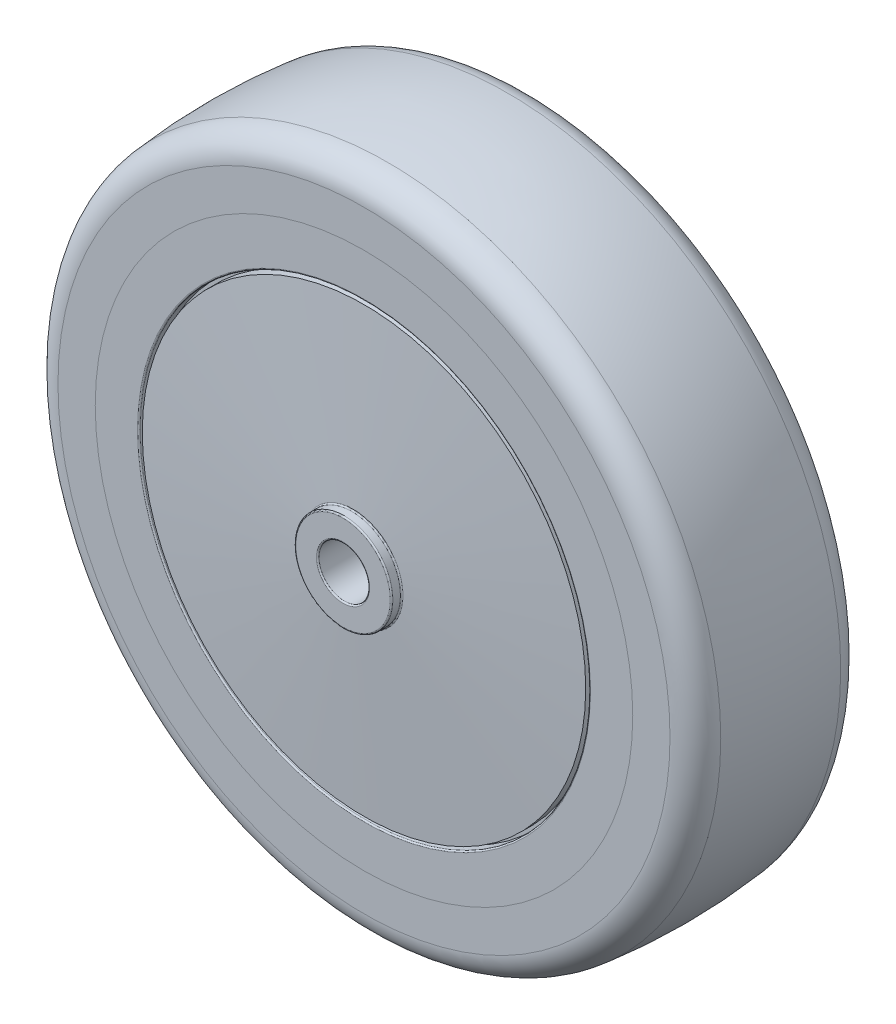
ISO-10303-21;
HEADER;
FILE_DESCRIPTION(('STEP AP214'),'2;1');
FILE_NAME('part.step','',(''),(''),'','','');
FILE_SCHEMA(('AUTOMOTIVE_DESIGN { 1 0 10303 214 1 1 1 1 }'));
ENDSEC;
DATA;
#1=APPLICATION_CONTEXT('core data for automotive mechanical design processes');
#2=APPLICATION_PROTOCOL_DEFINITION('international standard','automotive_design',2000,#1);
#3=PRODUCT_CONTEXT('',#1,'mechanical');
#4=PRODUCT('Part','Part','',(#3));
#5=PRODUCT_RELATED_PRODUCT_CATEGORY('part','',(#4));
#6=PRODUCT_DEFINITION_FORMATION('','',#4);
#7=PRODUCT_DEFINITION_CONTEXT('part definition',#1,'design');
#8=PRODUCT_DEFINITION('design','',#6,#7);
#9=PRODUCT_DEFINITION_SHAPE('','',#8);
#10=(LENGTH_UNIT() NAMED_UNIT(*) SI_UNIT(.MILLI.,.METRE.));
#11=(NAMED_UNIT(*) PLANE_ANGLE_UNIT() SI_UNIT($,.RADIAN.));
#12=(NAMED_UNIT(*) SI_UNIT($,.STERADIAN.) SOLID_ANGLE_UNIT());
#13=UNCERTAINTY_MEASURE_WITH_UNIT(LENGTH_MEASURE(1.E-05),#10,'distance_accuracy_value','');
#14=(GEOMETRIC_REPRESENTATION_CONTEXT(3) GLOBAL_UNCERTAINTY_ASSIGNED_CONTEXT((#13)) GLOBAL_UNIT_ASSIGNED_CONTEXT((#10,
#11,#12)) REPRESENTATION_CONTEXT('',''));
#15=CARTESIAN_POINT('',(0.,0.,0.));
#16=DIRECTION('',(0.,0.,1.));
#17=DIRECTION('',(1.,0.,0.));
#18=AXIS2_PLACEMENT_3D('',#15,#16,#17);
#19=CARTESIAN_POINT('',(0.,0.,-159.559097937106));
#20=DIRECTION('',(0.,0.,1.));
#21=DIRECTION('',(1.,0.,0.));
#22=AXIS2_PLACEMENT_3D('',#19,#20,#21);
#23=CYLINDRICAL_SURFACE('',#22,50.8);
#24=CARTESIAN_POINT('',(0.,0.,-15.875));
#25=DIRECTION('',(0.,0.,1.));
#26=DIRECTION('',(1.,0.,0.));
#27=AXIS2_PLACEMENT_3D('',#24,#25,#26);
#28=CIRCLE('',#27,50.8);
#29=CARTESIAN_POINT('',(50.8,0.,-15.875));
#30=VERTEX_POINT('',#29);
#31=EDGE_CURVE('E63',#30,#30,#28,.F.);
#32=ORIENTED_EDGE('',*,*,#31,.F.);
#33=EDGE_LOOP('',(#32));
#34=FACE_BOUND('',#33,.T.);
#35=CARTESIAN_POINT('',(0.,0.,15.875));
#36=DIRECTION('',(0.,0.,1.));
#37=DIRECTION('',(1.,0.,0.));
#38=AXIS2_PLACEMENT_3D('',#35,#36,#37);
#39=CIRCLE('',#38,50.8);
#40=CARTESIAN_POINT('',(50.8,0.,15.875));
#41=VERTEX_POINT('',#40);
#42=EDGE_CURVE('E64',#41,#41,#39,.T.);
#43=ORIENTED_EDGE('',*,*,#42,.F.);
#44=EDGE_LOOP('',(#43));
#45=FACE_BOUND('',#44,.T.);
#46=ADVANCED_FACE('F43',(#34,#45),#23,.T.);
#47=CARTESIAN_POINT('',(0.,0.,15.875));
#48=DIRECTION('',(0.,0.,1.));
#49=DIRECTION('',(1.,0.,0.));
#50=AXIS2_PLACEMENT_3D('',#47,#48,#49);
#51=PLANE('',#50);
#52=CARTESIAN_POINT('',(0.,0.,15.875));
#53=DIRECTION('',(0.,0.,1.));
#54=DIRECTION('',(1.,0.,0.));
#55=AXIS2_PLACEMENT_3D('',#52,#53,#54);
#56=CIRCLE('',#55,42.799);
#57=CARTESIAN_POINT('',(42.799,0.,15.875));
#58=VERTEX_POINT('',#57);
#59=EDGE_CURVE('E11',#58,#58,#56,.F.);
#60=ORIENTED_EDGE('',*,*,#59,.T.);
#61=EDGE_LOOP('',(#60));
#62=FACE_BOUND('',#61,.T.);
#63=ORIENTED_EDGE('',*,*,#42,.T.);
#64=EDGE_LOOP('',(#63));
#65=FACE_BOUND('',#64,.T.);
#66=ADVANCED_FACE('F74',(#62,#65),#51,.T.);
#67=CARTESIAN_POINT('',(0.,0.,-159.559097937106));
#68=DIRECTION('',(0.,0.,1.));
#69=DIRECTION('',(1.,0.,0.));
#70=AXIS2_PLACEMENT_3D('',#67,#68,#69);
#71=CYLINDRICAL_SURFACE('',#70,42.545);
#72=CARTESIAN_POINT('',(0.,0.,-15.621));
#73=DIRECTION('',(0.,0.,1.));
#74=DIRECTION('',(1.,0.,0.));
#75=AXIS2_PLACEMENT_3D('',#72,#73,#74);
#76=CIRCLE('',#75,42.545);
#77=CARTESIAN_POINT('',(42.545,0.,-15.621));
#78=VERTEX_POINT('',#77);
#79=EDGE_CURVE('E54',#78,#78,#76,.F.);
#80=ORIENTED_EDGE('',*,*,#79,.T.);
#81=EDGE_LOOP('',(#80));
#82=FACE_BOUND('',#81,.T.);
#83=CARTESIAN_POINT('',(0.,0.,15.621));
#84=DIRECTION('',(0.,0.,1.));
#85=DIRECTION('',(1.,0.,0.));
#86=AXIS2_PLACEMENT_3D('',#83,#84,#85);
#87=CIRCLE('',#86,42.545);
#88=CARTESIAN_POINT('',(42.545,0.,15.621));
#89=VERTEX_POINT('',#88);
#90=EDGE_CURVE('E58',#89,#89,#87,.T.);
#91=ORIENTED_EDGE('',*,*,#90,.T.);
#92=EDGE_LOOP('',(#91));
#93=FACE_BOUND('',#92,.T.);
#94=ADVANCED_FACE('F79',(#82,#93),#71,.F.);
#95=CARTESIAN_POINT('',(0.,0.,-15.875));
#96=DIRECTION('',(0.,0.,1.));
#97=DIRECTION('',(1.,0.,0.));
#98=AXIS2_PLACEMENT_3D('',#95,#96,#97);
#99=PLANE('',#98);
#100=CARTESIAN_POINT('',(0.,0.,-15.875));
#101=DIRECTION('',(0.,0.,1.));
#102=DIRECTION('',(1.,0.,0.));
#103=AXIS2_PLACEMENT_3D('',#100,#101,#102);
#104=CIRCLE('',#103,42.799);
#105=CARTESIAN_POINT('',(42.799,0.,-15.875));
#106=VERTEX_POINT('',#105);
#107=EDGE_CURVE('E50',#106,#106,#104,.T.);
#108=ORIENTED_EDGE('',*,*,#107,.T.);
#109=EDGE_LOOP('',(#108));
#110=FACE_BOUND('',#109,.T.);
#111=ORIENTED_EDGE('',*,*,#31,.T.);
#112=EDGE_LOOP('',(#111));
#113=FACE_BOUND('',#112,.T.);
#114=ADVANCED_FACE('F70',(#110,#113),#99,.F.);
#115=CARTESIAN_POINT('',(0.,0.,-15.621));
#116=DIRECTION('',(0.,0.,1.));
#117=DIRECTION('',(1.,0.,0.));
#118=AXIS2_PLACEMENT_3D('',#115,#116,#117);
#119=TOROIDAL_SURFACE('',#118,42.799,0.254);
#120=ORIENTED_EDGE('',*,*,#107,.F.);
#121=EDGE_LOOP('',(#120));
#122=FACE_BOUND('',#121,.T.);
#123=ORIENTED_EDGE('',*,*,#79,.F.);
#124=EDGE_LOOP('',(#123));
#125=FACE_BOUND('',#124,.T.);
#126=ADVANCED_FACE('F87',(#122,#125),#119,.T.);
#127=CARTESIAN_POINT('',(0.,0.,15.621));
#128=DIRECTION('',(0.,0.,1.));
#129=DIRECTION('',(1.,0.,0.));
#130=AXIS2_PLACEMENT_3D('',#127,#128,#129);
#131=TOROIDAL_SURFACE('',#130,42.799,0.254);
#132=ORIENTED_EDGE('',*,*,#59,.F.);
#133=EDGE_LOOP('',(#132));
#134=FACE_BOUND('',#133,.T.);
#135=ORIENTED_EDGE('',*,*,#90,.F.);
#136=EDGE_LOOP('',(#135));
#137=FACE_BOUND('',#136,.T.);
#138=ADVANCED_FACE('F45',(#134,#137),#131,.T.);
#139=CLOSED_SHELL('',(#46,#66,#94,#114,#126,#138));
#140=MANIFOLD_SOLID_BREP('B2',#139);
#141=CARTESIAN_POINT('',(0.,0.,0.));
#142=DIRECTION('',(0.,0.,1.));
#143=DIRECTION('',(1.,0.,0.));
#144=AXIS2_PLACEMENT_3D('',#141,#142,#143);
#145=DEGENERATE_TOROIDAL_SURFACE('',#144,42.8690785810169,106.369078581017,.F.);
#146=CARTESIAN_POINT('',(0.,0.,-11.3364068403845));
#147=DIRECTION('',(0.,0.,1.));
#148=DIRECTION('',(1.,0.,0.));
#149=AXIS2_PLACEMENT_3D('',#146,#147,#148);
#150=CIRCLE('',#149,62.8941794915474);
#151=CARTESIAN_POINT('',(62.8941794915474,0.,-11.3364068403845));
#152=VERTEX_POINT('',#151);
#153=EDGE_CURVE('E185',#152,#152,#150,.T.);
#154=ORIENTED_EDGE('',*,*,#153,.T.);
#155=EDGE_LOOP('',(#154));
#156=FACE_BOUND('',#155,.T.);
#157=CARTESIAN_POINT('',(0.,0.,11.3364068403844));
#158=DIRECTION('',(0.,0.,-1.));
#159=DIRECTION('',(-1.,0.,0.));
#160=AXIS2_PLACEMENT_3D('',#157,#158,#159);
#161=CIRCLE('',#160,62.8941794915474);
#162=CARTESIAN_POINT('',(-62.8941794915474,0.,11.3364068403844));
#163=VERTEX_POINT('',#162);
#164=EDGE_CURVE('E188',#163,#163,#161,.T.);
#165=ORIENTED_EDGE('',*,*,#164,.T.);
#166=EDGE_LOOP('',(#165));
#167=FACE_BOUND('',#166,.T.);
#168=ADVANCED_FACE('F135',(#156,#167),#145,.F.);
#169=CARTESIAN_POINT('',(0.,0.,-15.875));
#170=DIRECTION('',(0.,0.,1.));
#171=DIRECTION('',(1.,0.,0.));
#172=AXIS2_PLACEMENT_3D('',#169,#170,#171);
#173=PLANE('',#172);
#174=CARTESIAN_POINT('',(0.,0.,-15.875));
#175=DIRECTION('',(0.,0.,1.));
#176=DIRECTION('',(1.,0.,0.));
#177=AXIS2_PLACEMENT_3D('',#174,#175,#176);
#178=CIRCLE('',#177,57.8431124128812);
#179=CARTESIAN_POINT('',(57.8431124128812,0.,-15.875));
#180=VERTEX_POINT('',#179);
#181=EDGE_CURVE('E182',#180,#180,#178,.F.);
#182=ORIENTED_EDGE('',*,*,#181,.T.);
#183=EDGE_LOOP('',(#182));
#184=FACE_BOUND('',#183,.T.);
#185=CARTESIAN_POINT('',(0.,0.,-15.875));
#186=DIRECTION('',(0.,0.,1.));
#187=DIRECTION('',(1.,0.,0.));
#188=AXIS2_PLACEMENT_3D('',#185,#186,#187);
#189=CIRCLE('',#188,50.8);
#190=CARTESIAN_POINT('',(50.8,0.,-15.875));
#191=VERTEX_POINT('',#190);
#192=EDGE_CURVE('E197',#191,#191,#189,.T.);
#193=ORIENTED_EDGE('',*,*,#192,.T.);
#194=EDGE_LOOP('',(#193));
#195=FACE_BOUND('',#194,.T.);
#196=ADVANCED_FACE('F236',(#184,#195),#173,.F.);
#197=CARTESIAN_POINT('',(0.,0.,86.9689476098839));
#198=DIRECTION('',(0.,0.,1.));
#199=DIRECTION('',(1.,0.,0.));
#200=AXIS2_PLACEMENT_3D('',#197,#198,#199);
#201=CYLINDRICAL_SURFACE('',#200,50.8);
#202=ORIENTED_EDGE('',*,*,#192,.F.);
#203=EDGE_LOOP('',(#202));
#204=FACE_BOUND('',#203,.T.);
#205=CARTESIAN_POINT('',(0.,0.,-13.97));
#206=DIRECTION('',(0.,0.,1.));
#207=DIRECTION('',(1.,0.,0.));
#208=AXIS2_PLACEMENT_3D('',#205,#206,#207);
#209=CIRCLE('',#208,50.8);
#210=CARTESIAN_POINT('',(50.8,0.,-13.97));
#211=VERTEX_POINT('',#210);
#212=EDGE_CURVE('E200',#211,#211,#209,.T.);
#213=ORIENTED_EDGE('',*,*,#212,.T.);
#214=EDGE_LOOP('',(#213));
#215=FACE_BOUND('',#214,.T.);
#216=ADVANCED_FACE('F242',(#204,#215),#201,.F.);
#217=CARTESIAN_POINT('',(0.,0.,-13.97));
#218=DIRECTION('',(0.,0.,1.));
#219=DIRECTION('',(1.,0.,0.));
#220=AXIS2_PLACEMENT_3D('',#217,#218,#219);
#221=PLANE('',#220);
#222=CARTESIAN_POINT('',(0.,0.,-13.97));
#223=DIRECTION('',(0.,0.,1.));
#224=DIRECTION('',(1.,0.,0.));
#225=AXIS2_PLACEMENT_3D('',#222,#223,#224);
#226=CIRCLE('',#225,41.91);
#227=CARTESIAN_POINT('',(41.91,0.,-13.97));
#228=VERTEX_POINT('',#227);
#229=EDGE_CURVE('E191',#228,#228,#226,.F.);
#230=ORIENTED_EDGE('',*,*,#229,.F.);
#231=EDGE_LOOP('',(#230));
#232=FACE_BOUND('',#231,.T.);
#233=ORIENTED_EDGE('',*,*,#212,.F.);
#234=EDGE_LOOP('',(#233));
#235=FACE_BOUND('',#234,.T.);
#236=ADVANCED_FACE('F312',(#232,#235),#221,.F.);
#237=CARTESIAN_POINT('',(0.,0.,13.97));
#238=DIRECTION('',(0.,0.,1.));
#239=DIRECTION('',(1.,0.,0.));
#240=AXIS2_PLACEMENT_3D('',#237,#238,#239);
#241=PLANE('',#240);
#242=CARTESIAN_POINT('',(0.,0.,13.97));
#243=DIRECTION('',(0.,0.,1.));
#244=DIRECTION('',(1.,0.,0.));
#245=AXIS2_PLACEMENT_3D('',#242,#243,#244);
#246=CIRCLE('',#245,41.91);
#247=CARTESIAN_POINT('',(41.91,0.,13.97));
#248=VERTEX_POINT('',#247);
#249=EDGE_CURVE('E192',#248,#248,#246,.F.);
#250=ORIENTED_EDGE('',*,*,#249,.T.);
#251=EDGE_LOOP('',(#250));
#252=FACE_BOUND('',#251,.T.);
#253=CARTESIAN_POINT('',(0.,0.,13.97));
#254=DIRECTION('',(0.,0.,1.));
#255=DIRECTION('',(1.,0.,0.));
#256=AXIS2_PLACEMENT_3D('',#253,#254,#255);
#257=CIRCLE('',#256,50.8);
#258=CARTESIAN_POINT('',(50.8,0.,13.97));
#259=VERTEX_POINT('',#258);
#260=EDGE_CURVE('E203',#259,#259,#257,.T.);
#261=ORIENTED_EDGE('',*,*,#260,.T.);
#262=EDGE_LOOP('',(#261));
#263=FACE_BOUND('',#262,.T.);
#264=ADVANCED_FACE('F315',(#252,#263),#241,.T.);
#265=CARTESIAN_POINT('',(0.,0.,86.9689476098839));
#266=DIRECTION('',(0.,0.,1.));
#267=DIRECTION('',(1.,0.,0.));
#268=AXIS2_PLACEMENT_3D('',#265,#266,#267);
#269=CYLINDRICAL_SURFACE('',#268,50.8);
#270=CARTESIAN_POINT('',(0.,0.,15.875));
#271=DIRECTION('',(0.,0.,1.));
#272=DIRECTION('',(1.,0.,0.));
#273=AXIS2_PLACEMENT_3D('',#270,#271,#272);
#274=CIRCLE('',#273,50.8);
#275=CARTESIAN_POINT('',(50.8,0.,15.875));
#276=VERTEX_POINT('',#275);
#277=EDGE_CURVE('E195',#276,#276,#274,.T.);
#278=ORIENTED_EDGE('',*,*,#277,.T.);
#279=EDGE_LOOP('',(#278));
#280=FACE_BOUND('',#279,.T.);
#281=ORIENTED_EDGE('',*,*,#260,.F.);
#282=EDGE_LOOP('',(#281));
#283=FACE_BOUND('',#282,.T.);
#284=ADVANCED_FACE('F327',(#280,#283),#269,.F.);
#285=CARTESIAN_POINT('',(0.,0.,15.875));
#286=DIRECTION('',(0.,0.,1.));
#287=DIRECTION('',(1.,0.,0.));
#288=AXIS2_PLACEMENT_3D('',#285,#286,#287);
#289=PLANE('',#288);
#290=CARTESIAN_POINT('',(0.,0.,15.875));
#291=DIRECTION('',(0.,0.,1.));
#292=DIRECTION('',(1.,0.,0.));
#293=AXIS2_PLACEMENT_3D('',#290,#291,#292);
#294=CIRCLE('',#293,57.8431124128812);
#295=CARTESIAN_POINT('',(57.8431124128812,0.,15.875));
#296=VERTEX_POINT('',#295);
#297=EDGE_CURVE('E179',#296,#296,#294,.T.);
#298=ORIENTED_EDGE('',*,*,#297,.T.);
#299=EDGE_LOOP('',(#298));
#300=FACE_BOUND('',#299,.T.);
#301=ORIENTED_EDGE('',*,*,#277,.F.);
#302=EDGE_LOOP('',(#301));
#303=FACE_BOUND('',#302,.T.);
#304=ADVANCED_FACE('F298',(#300,#303),#289,.T.);
#305=CARTESIAN_POINT('',(0.,9.1821,19.84375));
#306=DIRECTION('',(0.,0.,-1.));
#307=DIRECTION('',(-1.,0.,0.));
#308=AXIS2_PLACEMENT_3D('',#305,#306,#307);
#309=PLANE('',#308);
#310=CARTESIAN_POINT('',(0.,0.,19.84375));
#311=DIRECTION('',(0.,0.,-1.));
#312=DIRECTION('',(-1.,0.,0.));
#313=AXIS2_PLACEMENT_3D('',#310,#311,#312);
#314=CIRCLE('',#313,5.0165);
#315=CARTESIAN_POINT('',(-5.0165,0.,19.84375));
#316=VERTEX_POINT('',#315);
#317=EDGE_CURVE('E42',#316,#316,#314,.T.);
#318=ORIENTED_EDGE('',*,*,#317,.T.);
#319=EDGE_LOOP('',(#318));
#320=FACE_BOUND('',#319,.T.);
#321=CARTESIAN_POINT('',(0.,0.,19.84375));
#322=DIRECTION('',(0.,0.,-1.));
#323=DIRECTION('',(-1.,0.,0.));
#324=AXIS2_PLACEMENT_3D('',#321,#322,#323);
#325=CIRCLE('',#324,8.9281);
#326=CARTESIAN_POINT('',(-8.9281,0.,19.84375));
#327=VERTEX_POINT('',#326);
#328=EDGE_CURVE('E142',#327,#327,#325,.F.);
#329=ORIENTED_EDGE('',*,*,#328,.T.);
#330=EDGE_LOOP('',(#329));
#331=FACE_BOUND('',#330,.T.);
#332=ADVANCED_FACE('F295',(#320,#331),#309,.F.);
#333=CARTESIAN_POINT('',(0.,0.,0.));
#334=DIRECTION('',(0.,0.,1.));
#335=DIRECTION('',(1.,0.,0.));
#336=AXIS2_PLACEMENT_3D('',#333,#334,#335);
#337=CYLINDRICAL_SURFACE('',#336,9.1821);
#338=CARTESIAN_POINT('',(0.,0.,18.1772378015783));
#339=DIRECTION('',(0.,0.,1.));
#340=DIRECTION('',(1.,0.,0.));
#341=AXIS2_PLACEMENT_3D('',#338,#339,#340);
#342=CIRCLE('',#341,9.1821);
#343=CARTESIAN_POINT('',(9.1821,0.,18.1772378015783));
#344=VERTEX_POINT('',#343);
#345=EDGE_CURVE('E173',#344,#344,#342,.T.);
#346=ORIENTED_EDGE('',*,*,#345,.T.);
#347=EDGE_LOOP('',(#346));
#348=FACE_BOUND('',#347,.T.);
#349=CARTESIAN_POINT('',(0.,0.,19.58975));
#350=DIRECTION('',(0.,0.,-1.));
#351=DIRECTION('',(-1.,0.,0.));
#352=AXIS2_PLACEMENT_3D('',#349,#350,#351);
#353=CIRCLE('',#352,9.1821);
#354=CARTESIAN_POINT('',(-9.1821,0.,19.58975));
#355=VERTEX_POINT('',#354);
#356=EDGE_CURVE('E176',#355,#355,#353,.T.);
#357=ORIENTED_EDGE('',*,*,#356,.T.);
#358=EDGE_LOOP('',(#357));
#359=FACE_BOUND('',#358,.T.);
#360=ADVANCED_FACE('F229',(#348,#359),#337,.T.);
#361=CARTESIAN_POINT('',(0.,0.,15.875));
#362=DIRECTION('',(0.,0.,-1.));
#363=DIRECTION('',(-1.,0.,0.));
#364=AXIS2_PLACEMENT_3D('',#361,#362,#363);
#365=CONICAL_SURFACE('',#364,41.91,1.50782188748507);
#366=CARTESIAN_POINT('',(0.,0.,17.9237412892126));
#367=DIRECTION('',(0.,0.,-1.));
#368=DIRECTION('',(-1.,0.,0.));
#369=AXIS2_PLACEMENT_3D('',#366,#367,#368);
#370=CIRCLE('',#369,9.42011506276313);
#371=CARTESIAN_POINT('',(-9.42011506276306,0.,17.9237412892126));
#372=VERTEX_POINT('',#371);
#373=EDGE_CURVE('E170',#372,#372,#370,.T.);
#374=CARTESIAN_POINT('',(0.,0.,15.875));
#375=DIRECTION('',(0.,0.,1.));
#376=DIRECTION('',(1.,0.,0.));
#377=AXIS2_PLACEMENT_3D('',#374,#375,#376);
#378=CIRCLE('',#377,41.91);
#379=CARTESIAN_POINT('',(-41.91,0.,15.875));
#380=VERTEX_POINT('',#379);
#381=EDGE_CURVE('E212',#380,#380,#378,.T.);
#382=CARTESIAN_POINT('',(-9.42011506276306,0.,17.9237412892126));
#383=CARTESIAN_POINT('',(-9.75855136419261,0.,17.9024002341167));
#384=CARTESIAN_POINT('',(-10.0969876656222,0.,17.8810591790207));
#385=CARTESIAN_POINT('',(-10.7738602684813,0.,17.8383770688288));
#386=CARTESIAN_POINT('',(-11.1122965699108,0.,17.8170360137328));
#387=CARTESIAN_POINT('',(-11.7891691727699,0.,17.7743539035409));
#388=CARTESIAN_POINT('',(-12.1276054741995,0.,17.7530128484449));
#389=CARTESIAN_POINT('',(-12.8044780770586,0.,17.710330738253));
#390=CARTESIAN_POINT('',(-13.1429143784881,0.,17.688989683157));
#391=CARTESIAN_POINT('',(-13.8197869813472,0.,17.6463075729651));
#392=CARTESIAN_POINT('',(-14.1582232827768,0.,17.6249665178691));
#393=CARTESIAN_POINT('',(-14.8350958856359,0.,17.5822844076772));
#394=CARTESIAN_POINT('',(-15.1735321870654,0.,17.5609433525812));
#395=CARTESIAN_POINT('',(-15.8504047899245,0.,17.5182612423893));
#396=CARTESIAN_POINT('',(-16.1888410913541,0.,17.4969201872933));
#397=CARTESIAN_POINT('',(-16.8657136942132,0.,17.4542380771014));
#398=CARTESIAN_POINT('',(-17.2041499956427,0.,17.4328970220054));
#399=CARTESIAN_POINT('',(-17.8810225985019,0.,17.3902149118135));
#400=CARTESIAN_POINT('',(-18.2194588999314,0.,17.3688738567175));
#401=CARTESIAN_POINT('',(-18.8963315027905,0.,17.3261917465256));
#402=CARTESIAN_POINT('',(-19.2347678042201,0.,17.3048506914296));
#403=CARTESIAN_POINT('',(-19.9116404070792,0.,17.2621685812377));
#404=CARTESIAN_POINT('',(-20.2500767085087,0.,17.2408275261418));
#405=CARTESIAN_POINT('',(-20.9269493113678,0.,17.1981454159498));
#406=CARTESIAN_POINT('',(-21.2653856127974,0.,17.1768043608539));
#407=CARTESIAN_POINT('',(-21.9422582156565,0.,17.1341222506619));
#408=CARTESIAN_POINT('',(-22.280694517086,0.,17.112781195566));
#409=CARTESIAN_POINT('',(-22.9575671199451,0.,17.070099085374));
#410=CARTESIAN_POINT('',(-23.2960034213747,0.,17.0487580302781));
#411=CARTESIAN_POINT('',(-23.9728760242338,0.,17.0060759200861));
#412=CARTESIAN_POINT('',(-24.3113123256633,0.,16.9847348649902));
#413=CARTESIAN_POINT('',(-24.9881849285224,0.,16.9420527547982));
#414=CARTESIAN_POINT('',(-25.326621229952,0.,16.9207116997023));
#415=CARTESIAN_POINT('',(-26.0034938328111,0.,16.8780295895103));
#416=CARTESIAN_POINT('',(-26.3419301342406,0.,16.8566885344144));
#417=CARTESIAN_POINT('',(-27.0188027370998,0.,16.8140064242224));
#418=CARTESIAN_POINT('',(-27.3572390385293,0.,16.7926653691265));
#419=CARTESIAN_POINT('',(-28.0341116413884,0.,16.7499832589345));
#420=CARTESIAN_POINT('',(-28.372547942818,0.,16.7286422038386));
#421=CARTESIAN_POINT('',(-29.0494205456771,0.,16.6859600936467));
#422=CARTESIAN_POINT('',(-29.3878568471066,0.,16.6646190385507));
#423=CARTESIAN_POINT('',(-30.0647294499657,0.,16.6219369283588));
#424=CARTESIAN_POINT('',(-30.4031657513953,0.,16.6005958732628));
#425=CARTESIAN_POINT('',(-31.0800383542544,0.,16.5579137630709));
#426=CARTESIAN_POINT('',(-31.4184746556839,0.,16.5365727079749));
#427=CARTESIAN_POINT('',(-32.095347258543,0.,16.493890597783));
#428=CARTESIAN_POINT('',(-32.4337835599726,0.,16.472549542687));
#429=CARTESIAN_POINT('',(-33.1106561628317,0.,16.4298674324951));
#430=CARTESIAN_POINT('',(-33.4490924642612,0.,16.4085263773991));
#431=CARTESIAN_POINT('',(-34.1259650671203,0.,16.3658442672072));
#432=CARTESIAN_POINT('',(-34.4644013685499,0.,16.3445032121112));
#433=CARTESIAN_POINT('',(-35.141273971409,0.,16.3018211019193));
#434=CARTESIAN_POINT('',(-35.4797102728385,0.,16.2804800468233));
#435=CARTESIAN_POINT('',(-36.1565828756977,0.,16.2377979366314));
#436=CARTESIAN_POINT('',(-36.4950191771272,0.,16.2164568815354));
#437=CARTESIAN_POINT('',(-37.1718917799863,0.,16.1737747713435));
#438=CARTESIAN_POINT('',(-37.5103280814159,0.,16.1524337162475));
#439=CARTESIAN_POINT('',(-38.187200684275,0.,16.1097516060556));
#440=CARTESIAN_POINT('',(-38.5256369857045,0.,16.0884105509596));
#441=CARTESIAN_POINT('',(-39.2025095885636,0.,16.0457284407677));
#442=CARTESIAN_POINT('',(-39.5409458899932,0.,16.0243873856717));
#443=CARTESIAN_POINT('',(-40.2178184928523,0.,15.9817052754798));
#444=CARTESIAN_POINT('',(-40.5562547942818,0.,15.9603642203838));
#445=CARTESIAN_POINT('',(-41.2331273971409,0.,15.9176821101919));
#446=CARTESIAN_POINT('',(-41.5715636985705,0.,15.8963410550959));
#447=CARTESIAN_POINT('',(-41.91,0.,15.875));
#448=B_SPLINE_CURVE_WITH_KNOTS('',3,(#382,#383,#384,#385,#386,#387,#388,#389,#390,#391,#392,
#393,#394,#395,#396,#397,#398,#399,#400,#401,#402,#403,#404,#405,#406,#407,#408,#409,#410,#411,
#412,#413,#414,#415,#416,#417,#418,#419,#420,#421,#422,#423,#424,#425,#426,#427,#428,#429,#430,
#431,#432,#433,#434,#435,#436,#437,#438,#439,#440,#441,#442,#443,#444,#445,#446,#447),
.UNSPECIFIED.,.F.,.F.,(4,2,2,2,2,2,2,2,2,2,2,2,2,2,2,2,2,2,2,2,2,2,2,2,2,2,2,2,2,2,2,2,4),(0.,
1.01732548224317,2.03465096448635,3.05197644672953,4.0693019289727,5.08662741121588,
6.10395289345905,7.12127837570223,8.13860385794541,9.15592934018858,10.1732548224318,
11.1905803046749,12.2079057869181,13.2252312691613,14.2425567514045,15.2598822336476,
16.2772077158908,17.294533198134,18.3118586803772,19.3291841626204,20.3465096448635,
21.3638351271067,22.3811606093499,23.3984860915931,24.4158115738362,25.4331370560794,
26.4504625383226,27.4677880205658,28.4851135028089,29.5024389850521,30.5197644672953,
31.5370899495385,32.5544154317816),.UNSPECIFIED.);
#449=EDGE_CURVE('BSEAM216',#372,#380,#448,.T.);
#450=ORIENTED_EDGE('',*,*,#373,.T.);
#451=ORIENTED_EDGE('',*,*,#381,.T.);
#452=ORIENTED_EDGE('',*,*,#449,.T.);
#453=ORIENTED_EDGE('',*,*,#449,.F.);
#454=EDGE_LOOP('',(#450,#452,#451,#453));
#455=FACE_BOUND('',#454,.T.);
#456=ADVANCED_FACE('F216',(#455),#365,.T.);
#457=CARTESIAN_POINT('',(0.,0.,0.));
#458=DIRECTION('',(0.,0.,1.));
#459=DIRECTION('',(1.,0.,0.));
#460=AXIS2_PLACEMENT_3D('',#457,#458,#459);
#461=CYLINDRICAL_SURFACE('',#460,41.91);
#462=ORIENTED_EDGE('',*,*,#249,.F.);
#463=EDGE_LOOP('',(#462));
#464=FACE_BOUND('',#463,.T.);
#465=ORIENTED_EDGE('',*,*,#381,.F.);
#466=EDGE_LOOP('',(#465));
#467=FACE_BOUND('',#466,.T.);
#468=ADVANCED_FACE('F218',(#464,#467),#461,.T.);
#469=CARTESIAN_POINT('',(0.,0.,-15.875));
#470=DIRECTION('',(0.,0.,1.));
#471=DIRECTION('',(1.,0.,0.));
#472=AXIS2_PLACEMENT_3D('',#469,#470,#471);
#473=CIRCLE('',#472,41.91);
#474=CARTESIAN_POINT('',(41.91,0.,-15.875));
#475=VERTEX_POINT('',#474);
#476=EDGE_CURVE('E196',#475,#475,#473,.T.);
#477=ORIENTED_EDGE('',*,*,#476,.T.);
#478=EDGE_LOOP('',(#477));
#479=FACE_BOUND('',#478,.T.);
#480=ORIENTED_EDGE('',*,*,#229,.T.);
#481=EDGE_LOOP('',(#480));
#482=FACE_BOUND('',#481,.T.);
#483=ADVANCED_FACE('F220',(#479,#482),#461,.T.);
#484=CARTESIAN_POINT('',(0.,0.,-17.93875));
#485=DIRECTION('',(0.,0.,1.));
#486=DIRECTION('',(1.,0.,0.));
#487=AXIS2_PLACEMENT_3D('',#484,#485,#486);
#488=CONICAL_SURFACE('',#487,9.18209999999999,1.50782188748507);
#489=CARTESIAN_POINT('',(0.,0.,-17.9237412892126));
#490=DIRECTION('',(0.,0.,1.));
#491=DIRECTION('',(1.,0.,0.));
#492=AXIS2_PLACEMENT_3D('',#489,#490,#491);
#493=CIRCLE('',#492,9.42011506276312);
#494=CARTESIAN_POINT('',(9.42011506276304,0.,-17.9237412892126));
#495=VERTEX_POINT('',#494);
#496=EDGE_CURVE('E167',#495,#495,#493,.T.);
#497=CARTESIAN_POINT('',(9.42011506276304,0.,-17.9237412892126));
#498=CARTESIAN_POINT('',(9.75855136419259,0.,-17.9024002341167));
#499=CARTESIAN_POINT('',(10.0969876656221,0.,-17.8810591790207));
#500=CARTESIAN_POINT('',(10.7738602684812,0.,-17.8383770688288));
#501=CARTESIAN_POINT('',(11.1122965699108,0.,-17.8170360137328));
#502=CARTESIAN_POINT('',(11.7891691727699,0.,-17.7743539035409));
#503=CARTESIAN_POINT('',(12.1276054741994,0.,-17.7530128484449));
#504=CARTESIAN_POINT('',(12.8044780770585,0.,-17.710330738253));
#505=CARTESIAN_POINT('',(13.1429143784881,0.,-17.688989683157));
#506=CARTESIAN_POINT('',(13.8197869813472,0.,-17.6463075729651));
#507=CARTESIAN_POINT('',(14.1582232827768,0.,-17.6249665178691));
#508=CARTESIAN_POINT('',(14.8350958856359,0.,-17.5822844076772));
#509=CARTESIAN_POINT('',(15.1735321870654,0.,-17.5609433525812));
#510=CARTESIAN_POINT('',(15.8504047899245,0.,-17.5182612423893));
#511=CARTESIAN_POINT('',(16.1888410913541,0.,-17.4969201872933));
#512=CARTESIAN_POINT('',(16.8657136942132,0.,-17.4542380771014));
#513=CARTESIAN_POINT('',(17.2041499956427,0.,-17.4328970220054));
#514=CARTESIAN_POINT('',(17.8810225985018,0.,-17.3902149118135));
#515=CARTESIAN_POINT('',(18.2194588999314,0.,-17.3688738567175));
#516=CARTESIAN_POINT('',(18.8963315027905,0.,-17.3261917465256));
#517=CARTESIAN_POINT('',(19.23476780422,0.,-17.3048506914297));
#518=CARTESIAN_POINT('',(19.9116404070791,0.,-17.2621685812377));
#519=CARTESIAN_POINT('',(20.2500767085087,0.,-17.2408275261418));
#520=CARTESIAN_POINT('',(20.9269493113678,0.,-17.1981454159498));
#521=CARTESIAN_POINT('',(21.2653856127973,0.,-17.1768043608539));
#522=CARTESIAN_POINT('',(21.9422582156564,0.,-17.1341222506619));
#523=CARTESIAN_POINT('',(22.280694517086,0.,-17.112781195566));
#524=CARTESIAN_POINT('',(22.9575671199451,0.,-17.070099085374));
#525=CARTESIAN_POINT('',(23.2960034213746,0.,-17.0487580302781));
#526=CARTESIAN_POINT('',(23.9728760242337,0.,-17.0060759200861));
#527=CARTESIAN_POINT('',(24.3113123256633,0.,-16.9847348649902));
#528=CARTESIAN_POINT('',(24.9881849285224,0.,-16.9420527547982));
#529=CARTESIAN_POINT('',(25.3266212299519,0.,-16.9207116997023));
#530=CARTESIAN_POINT('',(26.003493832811,0.,-16.8780295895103));
#531=CARTESIAN_POINT('',(26.3419301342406,0.,-16.8566885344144));
#532=CARTESIAN_POINT('',(27.0188027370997,0.,-16.8140064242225));
#533=CARTESIAN_POINT('',(27.3572390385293,0.,-16.7926653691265));
#534=CARTESIAN_POINT('',(28.0341116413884,0.,-16.7499832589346));
#535=CARTESIAN_POINT('',(28.3725479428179,0.,-16.7286422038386));
#536=CARTESIAN_POINT('',(29.049420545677,0.,-16.6859600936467));
#537=CARTESIAN_POINT('',(29.3878568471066,0.,-16.6646190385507));
#538=CARTESIAN_POINT('',(30.0647294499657,0.,-16.6219369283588));
#539=CARTESIAN_POINT('',(30.4031657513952,0.,-16.6005958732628));
#540=CARTESIAN_POINT('',(31.0800383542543,0.,-16.5579137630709));
#541=CARTESIAN_POINT('',(31.4184746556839,0.,-16.5365727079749));
#542=CARTESIAN_POINT('',(32.095347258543,0.,-16.493890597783));
#543=CARTESIAN_POINT('',(32.4337835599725,0.,-16.472549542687));
#544=CARTESIAN_POINT('',(33.1106561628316,0.,-16.4298674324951));
#545=CARTESIAN_POINT('',(33.4490924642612,0.,-16.4085263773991));
#546=CARTESIAN_POINT('',(34.1259650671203,0.,-16.3658442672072));
#547=CARTESIAN_POINT('',(34.4644013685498,0.,-16.3445032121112));
#548=CARTESIAN_POINT('',(35.1412739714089,0.,-16.3018211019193));
#549=CARTESIAN_POINT('',(35.4797102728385,0.,-16.2804800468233));
#550=CARTESIAN_POINT('',(36.1565828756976,0.,-16.2377979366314));
#551=CARTESIAN_POINT('',(36.4950191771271,0.,-16.2164568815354));
#552=CARTESIAN_POINT('',(37.1718917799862,0.,-16.1737747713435));
#553=CARTESIAN_POINT('',(37.5103280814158,0.,-16.1524337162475));
#554=CARTESIAN_POINT('',(38.1872006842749,0.,-16.1097516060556));
#555=CARTESIAN_POINT('',(38.5256369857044,0.,-16.0884105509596));
#556=CARTESIAN_POINT('',(39.2025095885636,0.,-16.0457284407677));
#557=CARTESIAN_POINT('',(39.5409458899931,0.,-16.0243873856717));
#558=CARTESIAN_POINT('',(40.2178184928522,0.,-15.9817052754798));
#559=CARTESIAN_POINT('',(40.5562547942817,0.,-15.9603642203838));
#560=CARTESIAN_POINT('',(41.2331273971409,0.,-15.9176821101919));
#561=CARTESIAN_POINT('',(41.5715636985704,0.,-15.8963410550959));
#562=CARTESIAN_POINT('',(41.91,0.,-15.875));
#563=B_SPLINE_CURVE_WITH_KNOTS('',3,(#497,#498,#499,#500,#501,#502,#503,#504,#505,#506,#507,
#508,#509,#510,#511,#512,#513,#514,#515,#516,#517,#518,#519,#520,#521,#522,#523,#524,#525,#526,
#527,#528,#529,#530,#531,#532,#533,#534,#535,#536,#537,#538,#539,#540,#541,#542,#543,#544,#545,
#546,#547,#548,#549,#550,#551,#552,#553,#554,#555,#556,#557,#558,#559,#560,#561,#562),
.UNSPECIFIED.,.F.,.F.,(4,2,2,2,2,2,2,2,2,2,2,2,2,2,2,2,2,2,2,2,2,2,2,2,2,2,2,2,2,2,2,2,4),(0.,
1.01732548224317,2.03465096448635,3.05197644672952,4.0693019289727,5.08662741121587,
6.10395289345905,7.12127837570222,8.1386038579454,9.15592934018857,10.1732548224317,
11.1905803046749,12.2079057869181,13.2252312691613,14.2425567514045,15.2598822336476,
16.2772077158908,17.294533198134,18.3118586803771,19.3291841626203,20.3465096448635,
21.3638351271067,22.3811606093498,23.398486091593,24.4158115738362,25.4331370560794,
26.4504625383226,27.4677880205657,28.4851135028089,29.5024389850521,30.5197644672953,
31.5370899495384,32.5544154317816),.UNSPECIFIED.);
#564=EDGE_CURVE('BSEAM227',#495,#475,#563,.T.);
#565=ORIENTED_EDGE('',*,*,#496,.T.);
#566=ORIENTED_EDGE('',*,*,#476,.F.);
#567=ORIENTED_EDGE('',*,*,#564,.T.);
#568=ORIENTED_EDGE('',*,*,#564,.F.);
#569=EDGE_LOOP('',(#565,#567,#566,#568));
#570=FACE_BOUND('',#569,.T.);
#571=ADVANCED_FACE('F227',(#570),#488,.T.);
#572=CARTESIAN_POINT('',(0.,0.,0.));
#573=DIRECTION('',(0.,0.,1.));
#574=DIRECTION('',(1.,0.,0.));
#575=AXIS2_PLACEMENT_3D('',#572,#573,#574);
#576=CYLINDRICAL_SURFACE('',#575,9.18209999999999);
#577=CARTESIAN_POINT('',(0.,0.,-18.1772378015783));
#578=DIRECTION('',(0.,0.,1.));
#579=DIRECTION('',(1.,0.,0.));
#580=AXIS2_PLACEMENT_3D('',#577,#578,#579);
#581=CIRCLE('',#580,9.18209999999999);
#582=CARTESIAN_POINT('',(9.18209999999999,0.,-18.1772378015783));
#583=VERTEX_POINT('',#582);
#584=EDGE_CURVE('E161',#583,#583,#581,.F.);
#585=ORIENTED_EDGE('',*,*,#584,.T.);
#586=EDGE_LOOP('',(#585));
#587=FACE_BOUND('',#586,.T.);
#588=CARTESIAN_POINT('',(0.,0.,-19.58975));
#589=DIRECTION('',(0.,0.,1.));
#590=DIRECTION('',(1.,0.,0.));
#591=AXIS2_PLACEMENT_3D('',#588,#589,#590);
#592=CIRCLE('',#591,9.18209999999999);
#593=CARTESIAN_POINT('',(9.18209999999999,0.,-19.58975));
#594=VERTEX_POINT('',#593);
#595=EDGE_CURVE('E164',#594,#594,#592,.T.);
#596=ORIENTED_EDGE('',*,*,#595,.T.);
#597=EDGE_LOOP('',(#596));
#598=FACE_BOUND('',#597,.T.);
#599=ADVANCED_FACE('F289',(#587,#598),#576,.T.);
#600=CARTESIAN_POINT('',(0.,9.18209999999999,-19.84375));
#601=DIRECTION('',(0.,0.,1.));
#602=DIRECTION('',(1.,0.,0.));
#603=AXIS2_PLACEMENT_3D('',#600,#601,#602);
#604=PLANE('',#603);
#605=CARTESIAN_POINT('',(0.,0.,-19.84375));
#606=DIRECTION('',(0.,0.,1.));
#607=DIRECTION('',(1.,0.,0.));
#608=AXIS2_PLACEMENT_3D('',#605,#606,#607);
#609=CIRCLE('',#608,5.0165);
#610=CARTESIAN_POINT('',(5.0165,0.,-19.84375));
#611=VERTEX_POINT('',#610);
#612=EDGE_CURVE('E155',#611,#611,#609,.T.);
#613=ORIENTED_EDGE('',*,*,#612,.T.);
#614=EDGE_LOOP('',(#613));
#615=FACE_BOUND('',#614,.T.);
#616=CARTESIAN_POINT('',(0.,0.,-19.84375));
#617=DIRECTION('',(0.,0.,1.));
#618=DIRECTION('',(1.,0.,0.));
#619=AXIS2_PLACEMENT_3D('',#616,#617,#618);
#620=CIRCLE('',#619,8.92809999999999);
#621=CARTESIAN_POINT('',(8.92809999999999,0.,-19.84375));
#622=VERTEX_POINT('',#621);
#623=EDGE_CURVE('E158',#622,#622,#620,.F.);
#624=ORIENTED_EDGE('',*,*,#623,.T.);
#625=EDGE_LOOP('',(#624));
#626=FACE_BOUND('',#625,.T.);
#627=ADVANCED_FACE('F283',(#615,#626),#604,.F.);
#628=CARTESIAN_POINT('',(0.,0.,-19.84375));
#629=DIRECTION('',(0.,0.,1.));
#630=DIRECTION('',(1.,0.,0.));
#631=AXIS2_PLACEMENT_3D('',#628,#629,#630);
#632=CYLINDRICAL_SURFACE('',#631,4.7625);
#633=CARTESIAN_POINT('',(0.,0.,-19.58975));
#634=DIRECTION('',(0.,0.,1.));
#635=DIRECTION('',(1.,0.,0.));
#636=AXIS2_PLACEMENT_3D('',#633,#634,#635);
#637=CIRCLE('',#636,4.7625);
#638=CARTESIAN_POINT('',(4.7625,0.,-19.58975));
#639=VERTEX_POINT('',#638);
#640=EDGE_CURVE('E146',#639,#639,#637,.F.);
#641=ORIENTED_EDGE('',*,*,#640,.T.);
#642=EDGE_LOOP('',(#641));
#643=FACE_BOUND('',#642,.T.);
#644=CARTESIAN_POINT('',(0.,0.,19.58975));
#645=DIRECTION('',(0.,0.,-1.));
#646=DIRECTION('',(-1.,0.,0.));
#647=AXIS2_PLACEMENT_3D('',#644,#645,#646);
#648=CIRCLE('',#647,4.7625);
#649=CARTESIAN_POINT('',(-4.7625,0.,19.58975));
#650=VERTEX_POINT('',#649);
#651=EDGE_CURVE('E150',#650,#650,#648,.F.);
#652=ORIENTED_EDGE('',*,*,#651,.T.);
#653=EDGE_LOOP('',(#652));
#654=FACE_BOUND('',#653,.T.);
#655=ADVANCED_FACE('F252',(#643,#654),#632,.F.);
#656=CARTESIAN_POINT('',(0.,0.,-10.795));
#657=DIRECTION('',(0.,0.,1.));
#658=DIRECTION('',(1.,0.,0.));
#659=AXIS2_PLACEMENT_3D('',#656,#657,#658);
#660=TOROIDAL_SURFACE('',#659,57.8431124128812,5.08);
#661=ORIENTED_EDGE('',*,*,#181,.F.);
#662=EDGE_LOOP('',(#661));
#663=FACE_BOUND('',#662,.T.);
#664=ORIENTED_EDGE('',*,*,#153,.F.);
#665=EDGE_LOOP('',(#664));
#666=FACE_BOUND('',#665,.T.);
#667=ADVANCED_FACE('F248',(#663,#666),#660,.T.);
#668=CARTESIAN_POINT('',(0.,0.,10.795));
#669=DIRECTION('',(0.,0.,1.));
#670=DIRECTION('',(1.,0.,0.));
#671=AXIS2_PLACEMENT_3D('',#668,#669,#670);
#672=TOROIDAL_SURFACE('',#671,57.8431124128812,5.08);
#673=ORIENTED_EDGE('',*,*,#164,.F.);
#674=EDGE_LOOP('',(#673));
#675=FACE_BOUND('',#674,.T.);
#676=ORIENTED_EDGE('',*,*,#297,.F.);
#677=EDGE_LOOP('',(#676));
#678=FACE_BOUND('',#677,.T.);
#679=ADVANCED_FACE('F251',(#675,#678),#672,.T.);
#680=CARTESIAN_POINT('',(0.,0.,18.1772378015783));
#681=DIRECTION('',(0.,0.,1.));
#682=DIRECTION('',(1.,0.,0.));
#683=AXIS2_PLACEMENT_3D('',#680,#681,#682);
#684=TOROIDAL_SURFACE('',#683,9.4361,0.254);
#685=ORIENTED_EDGE('',*,*,#373,.F.);
#686=EDGE_LOOP('',(#685));
#687=FACE_BOUND('',#686,.T.);
#688=ORIENTED_EDGE('',*,*,#345,.F.);
#689=EDGE_LOOP('',(#688));
#690=FACE_BOUND('',#689,.T.);
#691=ADVANCED_FACE('F256',(#687,#690),#684,.F.);
#692=CARTESIAN_POINT('',(0.,0.,-18.1772378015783));
#693=DIRECTION('',(0.,0.,1.));
#694=DIRECTION('',(1.,0.,0.));
#695=AXIS2_PLACEMENT_3D('',#692,#693,#694);
#696=TOROIDAL_SURFACE('',#695,9.43609999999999,0.254);
#697=ORIENTED_EDGE('',*,*,#584,.F.);
#698=EDGE_LOOP('',(#697));
#699=FACE_BOUND('',#698,.T.);
#700=ORIENTED_EDGE('',*,*,#496,.F.);
#701=EDGE_LOOP('',(#700));
#702=FACE_BOUND('',#701,.T.);
#703=ADVANCED_FACE('F260',(#699,#702),#696,.F.);
#704=CARTESIAN_POINT('',(0.,0.,-19.58975));
#705=DIRECTION('',(0.,0.,1.));
#706=DIRECTION('',(1.,0.,0.));
#707=AXIS2_PLACEMENT_3D('',#704,#705,#706);
#708=TOROIDAL_SURFACE('',#707,5.0165,0.254);
#709=ORIENTED_EDGE('',*,*,#640,.F.);
#710=EDGE_LOOP('',(#709));
#711=FACE_BOUND('',#710,.T.);
#712=ORIENTED_EDGE('',*,*,#612,.F.);
#713=EDGE_LOOP('',(#712));
#714=FACE_BOUND('',#713,.T.);
#715=ADVANCED_FACE('F264',(#711,#714),#708,.T.);
#716=CARTESIAN_POINT('',(0.,0.,-19.58975));
#717=DIRECTION('',(0.,0.,1.));
#718=DIRECTION('',(1.,0.,0.));
#719=AXIS2_PLACEMENT_3D('',#716,#717,#718);
#720=TOROIDAL_SURFACE('',#719,8.92809999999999,0.254);
#721=ORIENTED_EDGE('',*,*,#623,.F.);
#722=EDGE_LOOP('',(#721));
#723=FACE_BOUND('',#722,.T.);
#724=ORIENTED_EDGE('',*,*,#595,.F.);
#725=EDGE_LOOP('',(#724));
#726=FACE_BOUND('',#725,.T.);
#727=ADVANCED_FACE('F268',(#723,#726),#720,.T.);
#728=CARTESIAN_POINT('',(0.,0.,19.58975));
#729=DIRECTION('',(0.,0.,-1.));
#730=DIRECTION('',(-1.,0.,0.));
#731=AXIS2_PLACEMENT_3D('',#728,#729,#730);
#732=TOROIDAL_SURFACE('',#731,5.0165,0.254);
#733=ORIENTED_EDGE('',*,*,#317,.F.);
#734=EDGE_LOOP('',(#733));
#735=FACE_BOUND('',#734,.T.);
#736=ORIENTED_EDGE('',*,*,#651,.F.);
#737=EDGE_LOOP('',(#736));
#738=FACE_BOUND('',#737,.T.);
#739=ADVANCED_FACE('F271',(#735,#738),#732,.T.);
#740=CARTESIAN_POINT('',(0.,0.,19.58975));
#741=DIRECTION('',(0.,0.,-1.));
#742=DIRECTION('',(-1.,0.,0.));
#743=AXIS2_PLACEMENT_3D('',#740,#741,#742);
#744=TOROIDAL_SURFACE('',#743,8.9281,0.254);
#745=ORIENTED_EDGE('',*,*,#356,.F.);
#746=EDGE_LOOP('',(#745));
#747=FACE_BOUND('',#746,.T.);
#748=ORIENTED_EDGE('',*,*,#328,.F.);
#749=EDGE_LOOP('',(#748));
#750=FACE_BOUND('',#749,.T.);
#751=ADVANCED_FACE('F137',(#747,#750),#744,.T.);
#752=CLOSED_SHELL('',(#168,#196,#216,#236,#264,#284,#304,#332,#360,#456,#468,#483,#571,#599,
#627,#655,#667,#679,#691,#703,#715,#727,#739,#751));
#753=MANIFOLD_SOLID_BREP('B6',#752);
#754=ADVANCED_BREP_SHAPE_REPRESENTATION('',(#18,#140,#753),#14);
#755=SHAPE_DEFINITION_REPRESENTATION(#9,#754);
ENDSEC;
END-ISO-10303-21;
